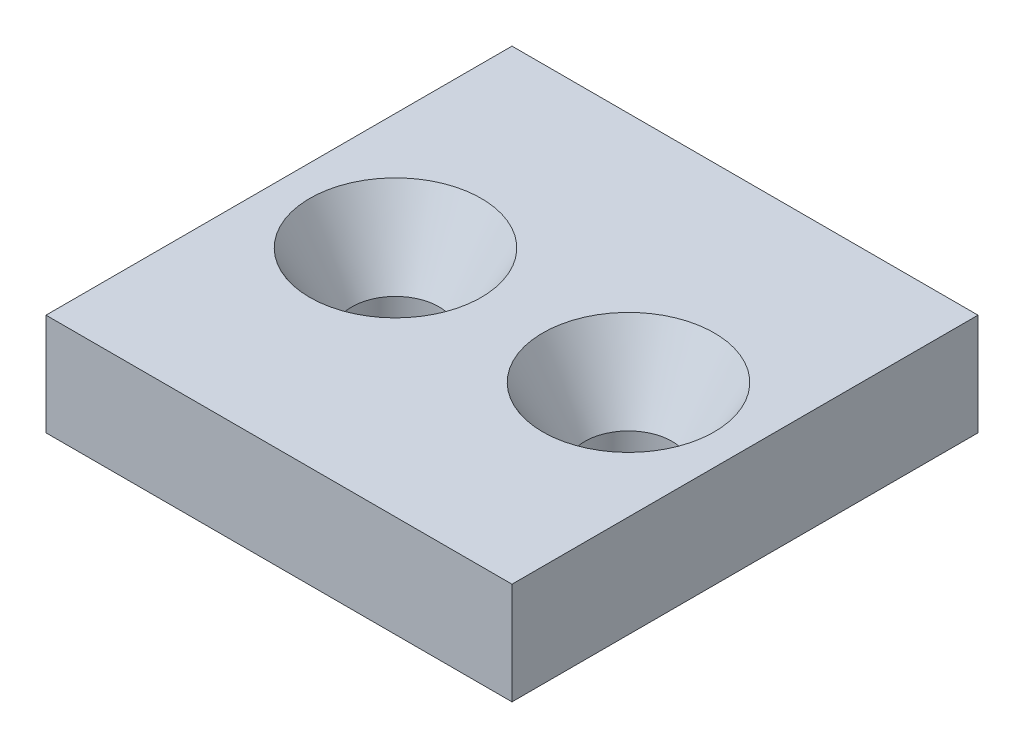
from build123d import *

# Parameters (mm, degrees)
SKETCH1_W                                      = 32
SKETCH1_H                                      = 32
BOSS_EXTRUDE1_DEPTH                            = 7
CSK_FOR_M6_FLAT_HEAD_MACHINE_SCREW1_AT_2_COUNT = 2
CSK_FOR_M6_FLAT_HEAD_MACHINE_SCREW1_AT_2_PITCH = 16


with BuildPart() as part:
    # Sketch1 → Boss-Extrude1 (new body)
    with BuildSketch(Plane(origin=(0, 0, 0), x_dir=(1, 0, 0), z_dir=(0, 1, 0))):
        Rectangle(SKETCH1_W, SKETCH1_H)
    extrude(amount=BOSS_EXTRUDE1_DEPTH)

    # Sketch2 → CSK for M6 Flat Head Machine Screw1 (revolve, cut)
    with BuildSketch(Plane(origin=(-8, 7, 0), x_dir=(0, 0, 1), z_dir=(1, 0, 0))):
        Polygon((0, 0), (0, 7), (3, 7), (3, 5.005626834), (5.89, 0), align=None)
    csk_for_m6_flat_head_machine_screw1 = revolve(axis=Axis((-8, 13.35, 0), (0, -1, 0)), mode=Mode.SUBTRACT)

    # CSK for M6 Flat Head Machine Screw1 at 2: CSK for M6 Flat Head Machine Screw1 ×2
    with Locations(*[(i * CSK_FOR_M6_FLAT_HEAD_MACHINE_SCREW1_AT_2_PITCH, 0, 0) for i in range(1, CSK_FOR_M6_FLAT_HEAD_MACHINE_SCREW1_AT_2_COUNT)]):
        add(csk_for_m6_flat_head_machine_screw1, mode=Mode.SUBTRACT)


solid = part.part
